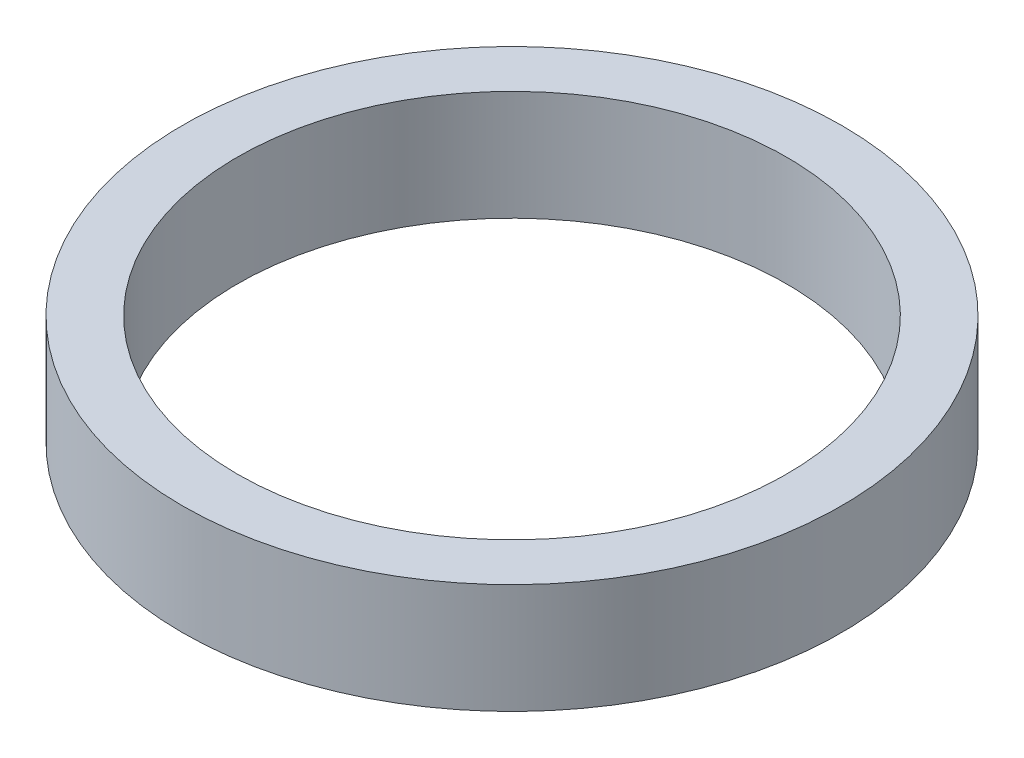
from build123d import *

# Parameters (mm, degrees)
ESQUISSE1_R      = 30
ESQUISSE1_R_2    = 25
EXTRUSION1_DEPTH = 10


with BuildPart() as part:
    # Esquisse1 → Extrusion1 (new body)
    with BuildSketch(Plane(origin=(0, 0, 0), x_dir=(1, 0, 0), z_dir=(0, 1, 0))):
        with Locations(Location((0, 0, 0), (0, 0, 270))):
            Circle(ESQUISSE1_R)
        with Locations(Location((0, 0, 0), (0, 0, 270))):
            Circle(ESQUISSE1_R_2, mode=Mode.SUBTRACT)
    extrude(amount=EXTRUSION1_DEPTH)


solid = part.part
